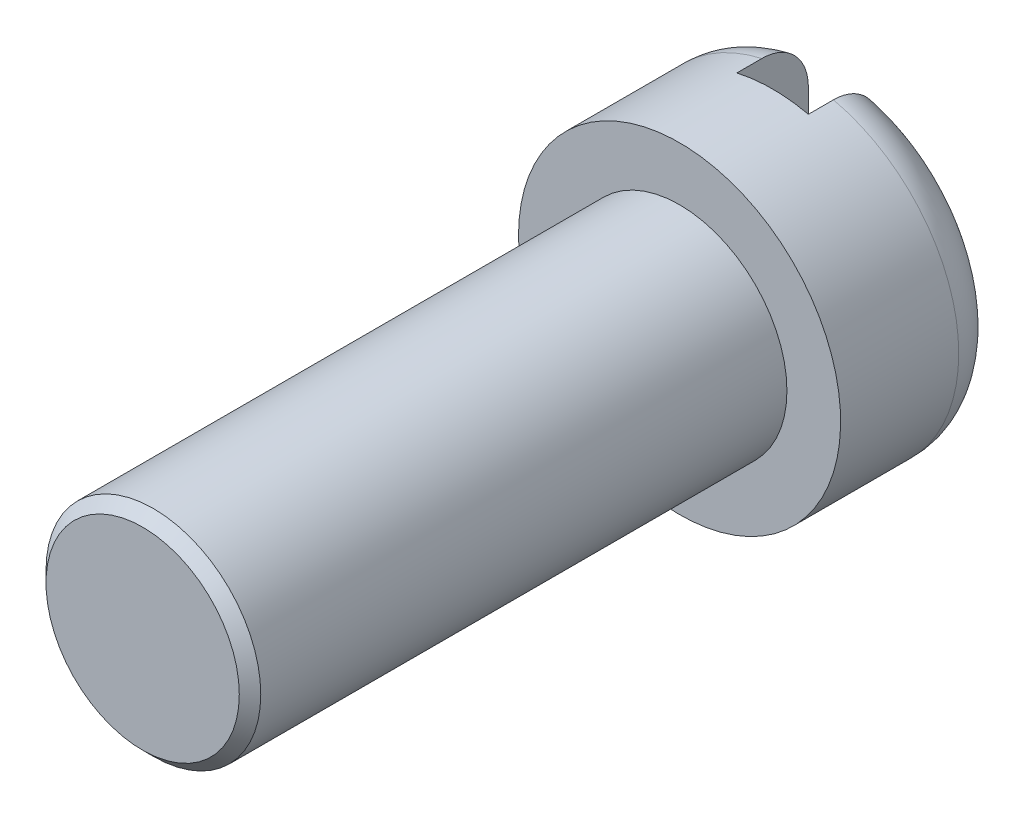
from build123d import *

# Parameters (mm, degrees)
ESQUISSE1_R                  = 3
BASE_EXTRUSION_DEPTH         = 15
CHANFREIN1_SIZE              = 0.3
ESQUISSE2_R                  = 4.5
BOSS_EXTRU_1_DEPTH           = 4.6
ENL_V_MAT_EXTRU_1_DEPTH      = 17.294170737
ENL_V_MAT_EXTRU_1_DEPTH_BACK = 17.294170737
ESQUISSE3_W                  = 2
ESQUISSE3_H                  = 2
CONG_2_R                     = 1.3


with BuildPart() as part:
    # Esquisse1 → Base-Extrusion (new body)
    with BuildSketch(Plane.XY):
        with Locations(Location((0, 0, 0), (0, 0, 180))):
            Circle(ESQUISSE1_R)
    extrude(amount=BASE_EXTRUSION_DEPTH)

    # Chanfrein1
    chanfrein1_edges = [part.edges().sort_by_distance(p)[0] for p in [
        (3, 0, 15),
    ]]
    chamfer(chanfrein1_edges, length=CHANFREIN1_SIZE)

    # Esquisse2 → Boss.-Extru.1 (add)
    with BuildSketch(Plane(origin=(0, 0, 0), x_dir=(-1, 0, 0), z_dir=(0, 0, -1))):
        with Locations(Location((0, 0, 0), (0, 0, 102.839588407))):
            Circle(ESQUISSE2_R)
    extrude(amount=BOSS_EXTRU_1_DEPTH)

    # Esquisse3 → Enl_v. mat.-Extru.1 (cut, two sides: drawn at the far end of the back side and taken through both)
    with BuildSketch(Plane(origin=(0, 0, 0), x_dir=(1, 0, 0), z_dir=(0, 1, 0)).offset(-ENL_V_MAT_EXTRU_1_DEPTH_BACK)):
        with Locations((0, 3.6)):
            Rectangle(ESQUISSE3_W, ESQUISSE3_H)
    extrude(amount=ENL_V_MAT_EXTRU_1_DEPTH + ENL_V_MAT_EXTRU_1_DEPTH_BACK, mode=Mode.SUBTRACT)

    # Cong_2
    cong_2_edges = [part.edges().sort_by_distance(p)[0] for p in [
        (-4.5, 0, -4.6),
        (4.5, 0, -4.6),
    ]]
    fillet(cong_2_edges, radius=CONG_2_R)


solid = part.part
